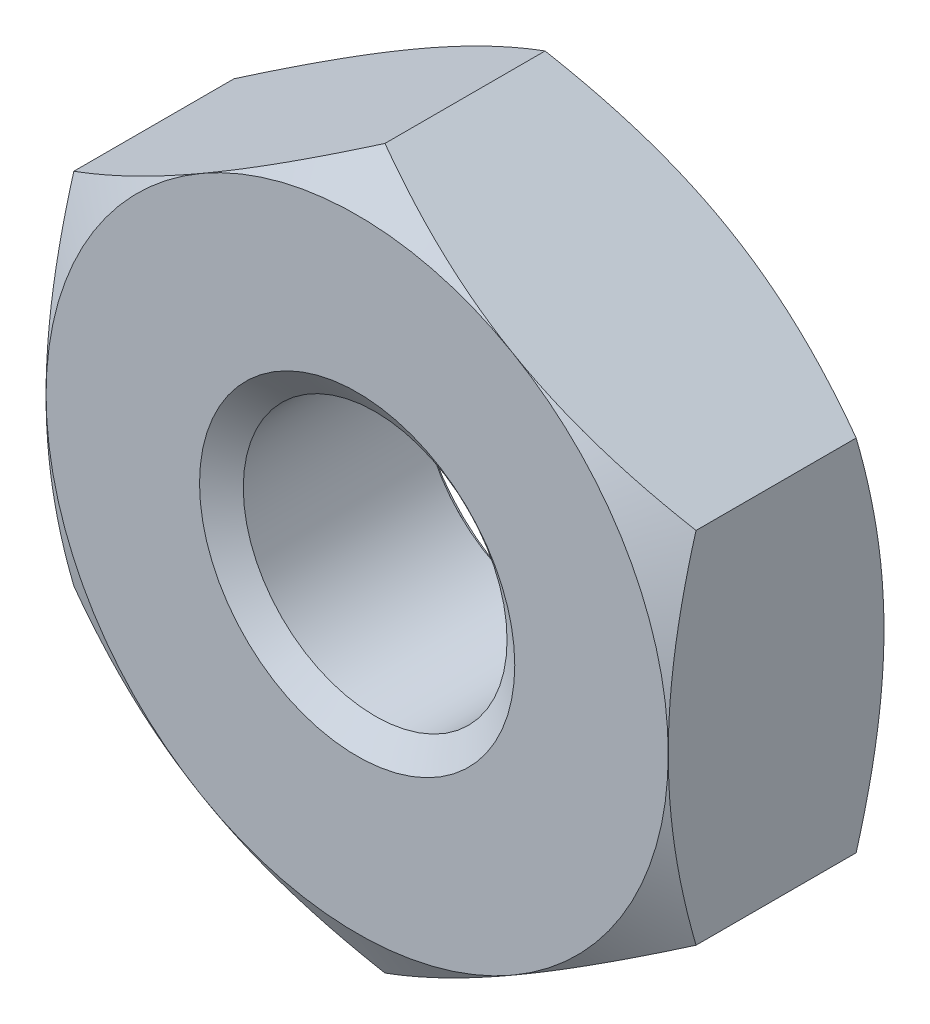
from build123d import *

# Parameters (mm, degrees)
BASENUTSKE_R  = 2.0193
BASENUT_DEPTH = 3.302


with BuildPart() as part:
    # BaseNutSke → BaseNut (new body)
    with BuildSketch(Plane.XY):
        Polygon((4.7625, 2.749630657), (4.7625, -2.749630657), (0, -5.499261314), (-4.7625, -2.749630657), (-4.7625, 2.749630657), (0, 5.499261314), align=None)
        Circle(BASENUTSKE_R, mode=Mode.SUBTRACT)
    extrude(amount=-BASENUT_DEPTH)

    # Sketch3 → Double-Chamfer (revolve, cut)
    with BuildSketch(Plane(origin=(0, 0, 0), x_dir=(0, 0, -1), z_dir=(1, 0, 0))):
        Polygon((3.302, 4.7625), (2.876630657, 5.499261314), (2.876630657, 18.199261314), (16.002, 18.199261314), (16.002, 4.7625), align=None)
        Polygon((0.425369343, 18.199261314), (-12.7, 18.199261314), (-12.7, 4.7625), (0, 4.7625), (0.425369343, 5.499261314), align=None)
    revolve(axis=Axis((0, 0, 0), (0, 0, -1)), mode=Mode.SUBTRACT)

    # EndChamferSketch → EndChamfer (revolve, cut)
    with BuildSketch(Plane(origin=(0, 0, 0), x_dir=(0, 0, -1), z_dir=(1, 0, 0)), mode=Mode.PRIVATE) as endchamfer_sk:
        Polygon((3.2766, 2.413), (2.973361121, 1.97993), (3.3274, 1.97993), (3.3274, 2.413), align=None)
        Polygon((-0.0508, 2.413), (0, 2.413), (0.303238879, 1.97993), (-0.0508, 1.97993), align=None)
    revolve(endchamfer_sk.sketch.rotate(Axis((0, 0, -25.037505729), (0, 0, -1)), 90), axis=Axis((0, 0, -25.037505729), (0, 0, -1)), mode=Mode.SUBTRACT)


solid = part.part
